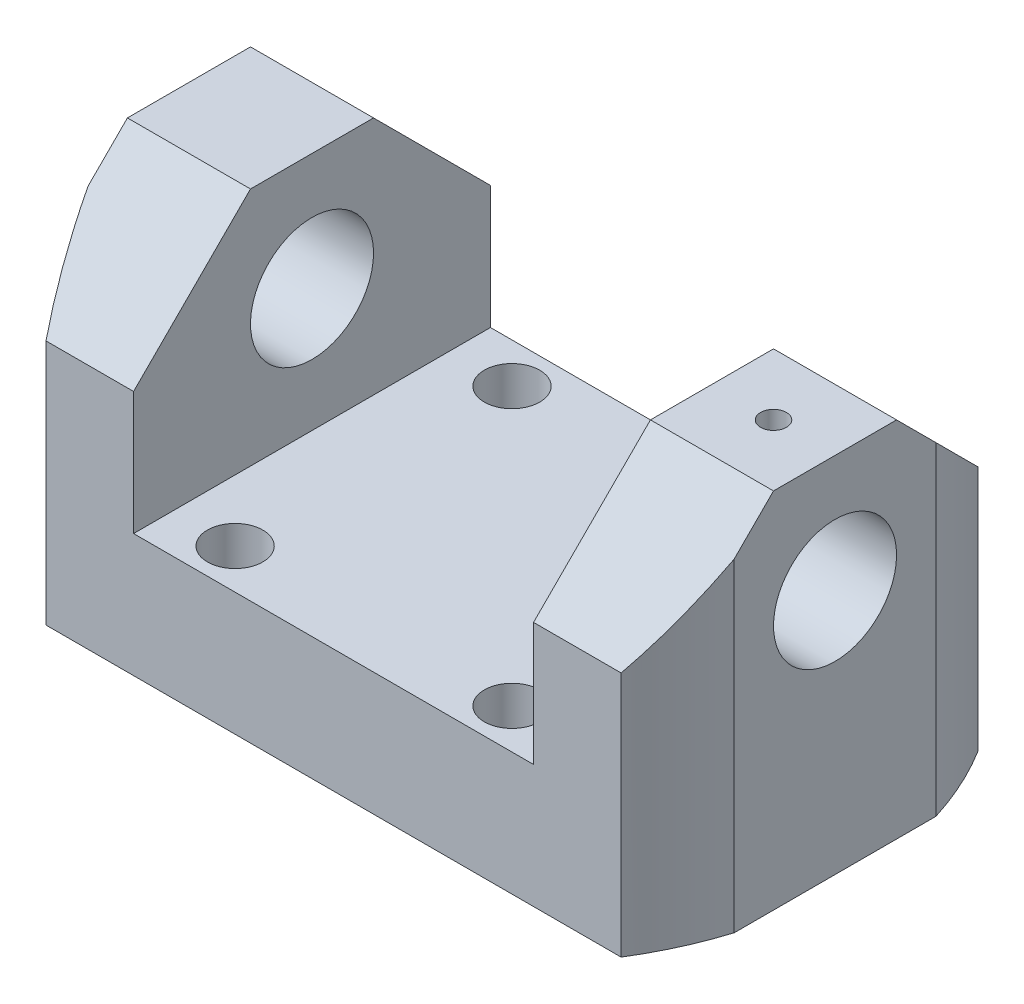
ISO-10303-21;
HEADER;
FILE_DESCRIPTION(('STEP AP214'),'2;1');
FILE_NAME('part.step','',(''),(''),'','','');
FILE_SCHEMA(('AUTOMOTIVE_DESIGN { 1 0 10303 214 1 1 1 1 }'));
ENDSEC;
DATA;
#1=APPLICATION_CONTEXT('core data for automotive mechanical design processes');
#2=APPLICATION_PROTOCOL_DEFINITION('international standard','automotive_design',2000,#1);
#3=PRODUCT_CONTEXT('',#1,'mechanical');
#4=PRODUCT('Part','Part','',(#3));
#5=PRODUCT_RELATED_PRODUCT_CATEGORY('part','',(#4));
#6=PRODUCT_DEFINITION_FORMATION('','',#4);
#7=PRODUCT_DEFINITION_CONTEXT('part definition',#1,'design');
#8=PRODUCT_DEFINITION('design','',#6,#7);
#9=PRODUCT_DEFINITION_SHAPE('','',#8);
#10=(LENGTH_UNIT() NAMED_UNIT(*) SI_UNIT(.MILLI.,.METRE.));
#11=(NAMED_UNIT(*) PLANE_ANGLE_UNIT() SI_UNIT($,.RADIAN.));
#12=(NAMED_UNIT(*) SI_UNIT($,.STERADIAN.) SOLID_ANGLE_UNIT());
#13=UNCERTAINTY_MEASURE_WITH_UNIT(LENGTH_MEASURE(1.E-05),#10,'distance_accuracy_value','');
#14=(GEOMETRIC_REPRESENTATION_CONTEXT(3) GLOBAL_UNCERTAINTY_ASSIGNED_CONTEXT((#13)) GLOBAL_UNIT_ASSIGNED_CONTEXT((#10,
#11,#12)) REPRESENTATION_CONTEXT('',''));
#15=CARTESIAN_POINT('',(0.,0.,0.));
#16=DIRECTION('',(0.,0.,1.));
#17=DIRECTION('',(1.,0.,0.));
#18=AXIS2_PLACEMENT_3D('',#15,#16,#17);
#19=CARTESIAN_POINT('',(105.,0.,58.));
#20=DIRECTION('',(0.,1.,0.));
#21=DIRECTION('',(-1.,0.,0.));
#22=AXIS2_PLACEMENT_3D('',#19,#20,#21);
#23=PLANE('',#22);
#24=CARTESIAN_POINT('',(30.,0.,6.50000000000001));
#25=DIRECTION('',(0.,1.,0.));
#26=DIRECTION('',(0.,0.,1.));
#27=AXIS2_PLACEMENT_3D('',#24,#25,#26);
#28=CIRCLE('',#27,4.5);
#29=CARTESIAN_POINT('',(30.,0.,11.));
#30=VERTEX_POINT('',#29);
#31=EDGE_CURVE('E271',#30,#30,#28,.T.);
#32=ORIENTED_EDGE('',*,*,#31,.T.);
#33=EDGE_LOOP('',(#32));
#34=FACE_BOUND('',#33,.T.);
#35=CARTESIAN_POINT('',(75.0000000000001,0.,6.50000000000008));
#36=DIRECTION('',(0.,1.,0.));
#37=DIRECTION('',(0.,0.,1.));
#38=AXIS2_PLACEMENT_3D('',#35,#36,#37);
#39=CIRCLE('',#38,4.5);
#40=CARTESIAN_POINT('',(75.0000000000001,0.,11.0000000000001));
#41=VERTEX_POINT('',#40);
#42=EDGE_CURVE('E277',#41,#41,#39,.T.);
#43=ORIENTED_EDGE('',*,*,#42,.T.);
#44=EDGE_LOOP('',(#43));
#45=FACE_BOUND('',#44,.T.);
#46=CARTESIAN_POINT('',(74.9999999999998,0.,51.5000000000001));
#47=DIRECTION('',(0.,1.,0.));
#48=DIRECTION('',(0.,0.,1.));
#49=AXIS2_PLACEMENT_3D('',#46,#47,#48);
#50=CIRCLE('',#49,4.5);
#51=CARTESIAN_POINT('',(74.9999999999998,0.,56.0000000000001));
#52=VERTEX_POINT('',#51);
#53=EDGE_CURVE('E283',#52,#52,#50,.T.);
#54=ORIENTED_EDGE('',*,*,#53,.T.);
#55=EDGE_LOOP('',(#54));
#56=FACE_BOUND('',#55,.T.);
#57=CARTESIAN_POINT('',(29.9999999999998,0.,51.4999999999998));
#58=DIRECTION('',(0.,1.,0.));
#59=DIRECTION('',(0.,0.,1.));
#60=AXIS2_PLACEMENT_3D('',#57,#58,#59);
#61=CIRCLE('',#60,4.5);
#62=CARTESIAN_POINT('',(29.9999999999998,0.,55.9999999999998));
#63=VERTEX_POINT('',#62);
#64=EDGE_CURVE('E289',#63,#63,#61,.T.);
#65=ORIENTED_EDGE('',*,*,#64,.T.);
#66=EDGE_LOOP('',(#65));
#67=FACE_BOUND('',#66,.T.);
#68=CARTESIAN_POINT('',(52.5,0.,29.));
#69=DIRECTION('',(0.,1.,0.));
#70=DIRECTION('',(0.,0.,1.));
#71=AXIS2_PLACEMENT_3D('',#68,#69,#70);
#72=CIRCLE('',#71,55.);
#73=CARTESIAN_POINT('',(0.,0.,45.393596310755));
#74=VERTEX_POINT('',#73);
#75=CARTESIAN_POINT('',(5.76671421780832,0.,58.));
#76=VERTEX_POINT('',#75);
#77=EDGE_CURVE('E160',#74,#76,#72,.T.);
#78=ORIENTED_EDGE('',*,*,#77,.F.);
#79=DIRECTION('',(0.,0.,-1.));
#80=VECTOR('',#79,1.);
#81=CARTESIAN_POINT('',(0.,0.,58.));
#82=LINE('',#81,#80);
#83=CARTESIAN_POINT('',(0.,0.,12.606403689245));
#84=VERTEX_POINT('',#83);
#85=EDGE_CURVE('E179',#74,#84,#82,.T.);
#86=ORIENTED_EDGE('',*,*,#85,.T.);
#87=CARTESIAN_POINT('',(5.76671421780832,0.,0.));
#88=VERTEX_POINT('',#87);
#89=EDGE_CURVE('E410',#88,#84,#72,.T.);
#90=ORIENTED_EDGE('',*,*,#89,.F.);
#91=DIRECTION('',(1.,0.,0.));
#92=VECTOR('',#91,1.);
#93=CARTESIAN_POINT('',(105.,0.,0.));
#94=LINE('',#93,#92);
#95=CARTESIAN_POINT('',(99.2332857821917,0.,0.));
#96=VERTEX_POINT('',#95);
#97=EDGE_CURVE('E180',#88,#96,#94,.T.);
#98=ORIENTED_EDGE('',*,*,#97,.T.);
#99=CARTESIAN_POINT('',(105.,0.,12.606403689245));
#100=VERTEX_POINT('',#99);
#101=EDGE_CURVE('E158',#100,#96,#72,.T.);
#102=ORIENTED_EDGE('',*,*,#101,.F.);
#103=DIRECTION('',(0.,0.,-1.));
#104=VECTOR('',#103,1.);
#105=CARTESIAN_POINT('',(105.,0.,58.));
#106=LINE('',#105,#104);
#107=CARTESIAN_POINT('',(105.,0.,45.393596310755));
#108=VERTEX_POINT('',#107);
#109=EDGE_CURVE('E156',#108,#100,#106,.T.);
#110=ORIENTED_EDGE('',*,*,#109,.F.);
#111=CARTESIAN_POINT('',(99.2332857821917,0.,58.));
#112=VERTEX_POINT('',#111);
#113=EDGE_CURVE('E143',#112,#108,#72,.T.);
#114=ORIENTED_EDGE('',*,*,#113,.F.);
#115=DIRECTION('',(1.,0.,0.));
#116=VECTOR('',#115,1.);
#117=CARTESIAN_POINT('',(105.,0.,58.));
#118=LINE('',#117,#116);
#119=EDGE_CURVE('E153',#76,#112,#118,.T.);
#120=ORIENTED_EDGE('',*,*,#119,.F.);
#121=EDGE_LOOP('',(#78,#86,#90,#98,#102,#110,#114,#120));
#122=FACE_BOUND('',#121,.T.);
#123=ADVANCED_FACE('F31',(#34,#45,#56,#67,#122),#23,.F.);
#124=CARTESIAN_POINT('',(105.,59.,58.));
#125=DIRECTION('',(-1.,0.,0.));
#126=DIRECTION('',(0.,-1.,0.));
#127=AXIS2_PLACEMENT_3D('',#124,#125,#126);
#128=PLANE('',#127);
#129=CARTESIAN_POINT('',(105.,40.,29.));
#130=DIRECTION('',(1.,0.,0.));
#131=DIRECTION('',(0.,0.,-1.));
#132=AXIS2_PLACEMENT_3D('',#129,#130,#131);
#133=CIRCLE('',#132,9.99999999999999);
#134=CARTESIAN_POINT('',(105.,40.,19.));
#135=VERTEX_POINT('',#134);
#136=EDGE_CURVE('E292',#135,#135,#133,.T.);
#137=ORIENTED_EDGE('',*,*,#136,.F.);
#138=EDGE_LOOP('',(#137));
#139=FACE_BOUND('',#138,.T.);
#140=DIRECTION('',(0.,1.,0.));
#141=VECTOR('',#140,1.);
#142=CARTESIAN_POINT('',(105.,0.,45.393596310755));
#143=LINE('',#142,#141);
#144=CARTESIAN_POINT('',(105.,52.6064036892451,45.3935963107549));
#145=VERTEX_POINT('',#144);
#146=EDGE_CURVE('E53',#108,#145,#143,.T.);
#147=ORIENTED_EDGE('',*,*,#146,.F.);
#148=ORIENTED_EDGE('',*,*,#109,.T.);
#149=DIRECTION('',(0.,1.,0.));
#150=VECTOR('',#149,1.);
#151=CARTESIAN_POINT('',(105.,0.,12.606403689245));
#152=LINE('',#151,#150);
#153=CARTESIAN_POINT('',(105.,52.606403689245,12.606403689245));
#154=VERTEX_POINT('',#153);
#155=EDGE_CURVE('E404',#154,#100,#152,.F.);
#156=ORIENTED_EDGE('',*,*,#155,.F.);
#157=DIRECTION('',(0.,0.707106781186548,0.707106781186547));
#158=VECTOR('',#157,1.);
#159=CARTESIAN_POINT('',(105.,59.,19.));
#160=LINE('',#159,#158);
#161=CARTESIAN_POINT('',(105.,59.,19.));
#162=VERTEX_POINT('',#161);
#163=EDGE_CURVE('E381',#154,#162,#160,.T.);
#164=ORIENTED_EDGE('',*,*,#163,.T.);
#165=DIRECTION('',(0.,0.,-1.));
#166=VECTOR('',#165,1.);
#167=CARTESIAN_POINT('',(105.,59.,58.));
#168=LINE('',#167,#166);
#169=CARTESIAN_POINT('',(105.,59.,39.));
#170=VERTEX_POINT('',#169);
#171=EDGE_CURVE('E203',#170,#162,#168,.T.);
#172=ORIENTED_EDGE('',*,*,#171,.F.);
#173=DIRECTION('',(0.,-0.707106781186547,0.707106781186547));
#174=VECTOR('',#173,1.);
#175=CARTESIAN_POINT('',(105.,59.,39.));
#176=LINE('',#175,#174);
#177=EDGE_CURVE('E251',#170,#145,#176,.T.);
#178=ORIENTED_EDGE('',*,*,#177,.T.);
#179=EDGE_LOOP('',(#147,#148,#156,#164,#172,#178));
#180=FACE_BOUND('',#179,.T.);
#181=ADVANCED_FACE('F324',(#139,#180),#128,.F.);
#182=CARTESIAN_POINT('',(0.,0.,58.));
#183=DIRECTION('',(1.,0.,0.));
#184=DIRECTION('',(0.,0.,-1.));
#185=AXIS2_PLACEMENT_3D('',#182,#183,#184);
#186=PLANE('',#185);
#187=CARTESIAN_POINT('',(0.,40.,29.));
#188=DIRECTION('',(1.,0.,0.));
#189=DIRECTION('',(0.,0.,-1.));
#190=AXIS2_PLACEMENT_3D('',#187,#188,#189);
#191=CIRCLE('',#190,9.99999999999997);
#192=CARTESIAN_POINT('',(0.,40.,19.));
#193=VERTEX_POINT('',#192);
#194=EDGE_CURVE('E295',#193,#193,#191,.T.);
#195=ORIENTED_EDGE('',*,*,#194,.T.);
#196=EDGE_LOOP('',(#195));
#197=FACE_BOUND('',#196,.T.);
#198=DIRECTION('',(0.,1.,0.));
#199=VECTOR('',#198,1.);
#200=CARTESIAN_POINT('',(0.,0.,12.606403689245));
#201=LINE('',#200,#199);
#202=CARTESIAN_POINT('',(0.,52.606403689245,12.606403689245));
#203=VERTEX_POINT('',#202);
#204=EDGE_CURVE('E416',#84,#203,#201,.T.);
#205=ORIENTED_EDGE('',*,*,#204,.F.);
#206=ORIENTED_EDGE('',*,*,#85,.F.);
#207=DIRECTION('',(0.,1.,0.));
#208=VECTOR('',#207,1.);
#209=CARTESIAN_POINT('',(0.,0.,45.393596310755));
#210=LINE('',#209,#208);
#211=CARTESIAN_POINT('',(0.,52.6064036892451,45.3935963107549));
#212=VERTEX_POINT('',#211);
#213=EDGE_CURVE('E370',#212,#74,#210,.F.);
#214=ORIENTED_EDGE('',*,*,#213,.F.);
#215=DIRECTION('',(0.,-0.707106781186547,0.707106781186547));
#216=VECTOR('',#215,1.);
#217=CARTESIAN_POINT('',(0.,59.,39.));
#218=LINE('',#217,#216);
#219=CARTESIAN_POINT('',(0.,59.,39.));
#220=VERTEX_POINT('',#219);
#221=EDGE_CURVE('E248',#220,#212,#218,.T.);
#222=ORIENTED_EDGE('',*,*,#221,.F.);
#223=DIRECTION('',(0.,0.,-1.));
#224=VECTOR('',#223,1.);
#225=CARTESIAN_POINT('',(0.,59.,58.));
#226=LINE('',#225,#224);
#227=CARTESIAN_POINT('',(0.,59.,19.));
#228=VERTEX_POINT('',#227);
#229=EDGE_CURVE('E188',#220,#228,#226,.T.);
#230=ORIENTED_EDGE('',*,*,#229,.T.);
#231=DIRECTION('',(0.,0.707106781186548,0.707106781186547));
#232=VECTOR('',#231,1.);
#233=CARTESIAN_POINT('',(0.,59.,19.));
#234=LINE('',#233,#232);
#235=EDGE_CURVE('E372',#203,#228,#234,.T.);
#236=ORIENTED_EDGE('',*,*,#235,.F.);
#237=EDGE_LOOP('',(#205,#206,#214,#222,#230,#236));
#238=FACE_BOUND('',#237,.T.);
#239=ADVANCED_FACE('F329',(#197,#238),#186,.F.);
#240=CARTESIAN_POINT('',(0.,0.,58.));
#241=DIRECTION('',(0.,0.,-1.));
#242=DIRECTION('',(-1.,0.,0.));
#243=AXIS2_PLACEMENT_3D('',#240,#241,#242);
#244=PLANE('',#243);
#245=DIRECTION('',(0.,1.,0.));
#246=VECTOR('',#245,1.);
#247=CARTESIAN_POINT('',(5.76671421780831,0.,58.));
#248=LINE('',#247,#246);
#249=CARTESIAN_POINT('',(5.76671421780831,40.,58.));
#250=VERTEX_POINT('',#249);
#251=EDGE_CURVE('E45',#76,#250,#248,.T.);
#252=ORIENTED_EDGE('',*,*,#251,.F.);
#253=ORIENTED_EDGE('',*,*,#119,.T.);
#254=DIRECTION('',(0.,1.,0.));
#255=VECTOR('',#254,1.);
#256=CARTESIAN_POINT('',(99.2332857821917,0.,58.));
#257=LINE('',#256,#255);
#258=CARTESIAN_POINT('',(99.2332857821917,40.,58.));
#259=VERTEX_POINT('',#258);
#260=EDGE_CURVE('E140',#259,#112,#257,.F.);
#261=ORIENTED_EDGE('',*,*,#260,.F.);
#262=DIRECTION('',(-1.,0.,0.));
#263=VECTOR('',#262,1.);
#264=CARTESIAN_POINT('',(105.,40.,58.));
#265=LINE('',#264,#263);
#266=CARTESIAN_POINT('',(85.,40.,58.));
#267=VERTEX_POINT('',#266);
#268=EDGE_CURVE('E260',#259,#267,#265,.T.);
#269=ORIENTED_EDGE('',*,*,#268,.T.);
#270=DIRECTION('',(0.,-1.,0.));
#271=VECTOR('',#270,1.);
#272=CARTESIAN_POINT('',(85.,20.,58.));
#273=LINE('',#272,#271);
#274=CARTESIAN_POINT('',(85.,20.,58.));
#275=VERTEX_POINT('',#274);
#276=EDGE_CURVE('E163',#267,#275,#273,.T.);
#277=ORIENTED_EDGE('',*,*,#276,.T.);
#278=DIRECTION('',(-1.,0.,0.));
#279=VECTOR('',#278,1.);
#280=CARTESIAN_POINT('',(20.,20.,58.));
#281=LINE('',#280,#279);
#282=CARTESIAN_POINT('',(20.,20.,58.));
#283=VERTEX_POINT('',#282);
#284=EDGE_CURVE('E166',#275,#283,#281,.T.);
#285=ORIENTED_EDGE('',*,*,#284,.T.);
#286=DIRECTION('',(0.,1.,0.));
#287=VECTOR('',#286,1.);
#288=CARTESIAN_POINT('',(20.,59.,58.));
#289=LINE('',#288,#287);
#290=CARTESIAN_POINT('',(20.,40.,58.));
#291=VERTEX_POINT('',#290);
#292=EDGE_CURVE('E176',#283,#291,#289,.T.);
#293=ORIENTED_EDGE('',*,*,#292,.T.);
#294=DIRECTION('',(-1.,0.,0.));
#295=VECTOR('',#294,1.);
#296=CARTESIAN_POINT('',(0.,40.,58.));
#297=LINE('',#296,#295);
#298=EDGE_CURVE('E207',#291,#250,#297,.T.);
#299=ORIENTED_EDGE('',*,*,#298,.T.);
#300=EDGE_LOOP('',(#252,#253,#261,#269,#277,#285,#293,#299));
#301=FACE_BOUND('',#300,.T.);
#302=ADVANCED_FACE('F161',(#301),#244,.F.);
#303=CARTESIAN_POINT('',(0.,0.,0.));
#304=DIRECTION('',(0.,0.,-1.));
#305=DIRECTION('',(-1.,0.,0.));
#306=AXIS2_PLACEMENT_3D('',#303,#304,#305);
#307=PLANE('',#306);
#308=ORIENTED_EDGE('',*,*,#97,.F.);
#309=DIRECTION('',(0.,1.,0.));
#310=VECTOR('',#309,1.);
#311=CARTESIAN_POINT('',(5.76671421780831,0.,0.));
#312=LINE('',#311,#310);
#313=CARTESIAN_POINT('',(5.76671421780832,40.,0.));
#314=VERTEX_POINT('',#313);
#315=EDGE_CURVE('E223',#88,#314,#312,.T.);
#316=ORIENTED_EDGE('',*,*,#315,.T.);
#317=DIRECTION('',(-1.,0.,0.));
#318=VECTOR('',#317,1.);
#319=CARTESIAN_POINT('',(0.,40.,0.));
#320=LINE('',#319,#318);
#321=CARTESIAN_POINT('',(20.,40.,0.));
#322=VERTEX_POINT('',#321);
#323=EDGE_CURVE('E38',#322,#314,#320,.T.);
#324=ORIENTED_EDGE('',*,*,#323,.F.);
#325=DIRECTION('',(0.,1.,0.));
#326=VECTOR('',#325,1.);
#327=CARTESIAN_POINT('',(20.,59.,0.));
#328=LINE('',#327,#326);
#329=CARTESIAN_POINT('',(20.,20.,0.));
#330=VERTEX_POINT('',#329);
#331=EDGE_CURVE('E164',#330,#322,#328,.T.);
#332=ORIENTED_EDGE('',*,*,#331,.F.);
#333=DIRECTION('',(-1.,0.,0.));
#334=VECTOR('',#333,1.);
#335=CARTESIAN_POINT('',(20.,20.,0.));
#336=LINE('',#335,#334);
#337=CARTESIAN_POINT('',(85.,20.,0.));
#338=VERTEX_POINT('',#337);
#339=EDGE_CURVE('E169',#338,#330,#336,.T.);
#340=ORIENTED_EDGE('',*,*,#339,.F.);
#341=DIRECTION('',(0.,-1.,0.));
#342=VECTOR('',#341,1.);
#343=CARTESIAN_POINT('',(85.,20.,0.));
#344=LINE('',#343,#342);
#345=CARTESIAN_POINT('',(85.,40.,0.));
#346=VERTEX_POINT('',#345);
#347=EDGE_CURVE('E183',#346,#338,#344,.T.);
#348=ORIENTED_EDGE('',*,*,#347,.F.);
#349=DIRECTION('',(-1.,0.,0.));
#350=VECTOR('',#349,1.);
#351=CARTESIAN_POINT('',(105.,40.,0.));
#352=LINE('',#351,#350);
#353=CARTESIAN_POINT('',(99.2332857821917,40.,0.));
#354=VERTEX_POINT('',#353);
#355=EDGE_CURVE('E237',#354,#346,#352,.T.);
#356=ORIENTED_EDGE('',*,*,#355,.F.);
#357=DIRECTION('',(0.,1.,0.));
#358=VECTOR('',#357,1.);
#359=CARTESIAN_POINT('',(99.2332857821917,0.,0.));
#360=LINE('',#359,#358);
#361=EDGE_CURVE('E157',#354,#96,#360,.F.);
#362=ORIENTED_EDGE('',*,*,#361,.T.);
#363=EDGE_LOOP('',(#308,#316,#324,#332,#340,#348,#356,#362));
#364=FACE_BOUND('',#363,.T.);
#365=ADVANCED_FACE('F221',(#364),#307,.T.);
#366=CARTESIAN_POINT('',(105.,59.,39.));
#367=DIRECTION('',(0.,-0.707106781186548,-0.707106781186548));
#368=DIRECTION('',(0.,0.707106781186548,-0.707106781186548));
#369=AXIS2_PLACEMENT_3D('',#366,#367,#368);
#370=PLANE('',#369);
#371=CARTESIAN_POINT('',(52.5,69.,29.));
#372=DIRECTION('',(0.,-0.707106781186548,-0.707106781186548));
#373=DIRECTION('',(0.,0.707106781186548,-0.707106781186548));
#374=AXIS2_PLACEMENT_3D('',#371,#372,#373);
#375=ELLIPSE('',#374,77.7817459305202,55.);
#376=EDGE_CURVE('E411',#250,#212,#375,.T.);
#377=ORIENTED_EDGE('',*,*,#376,.F.);
#378=ORIENTED_EDGE('',*,*,#298,.F.);
#379=DIRECTION('',(0.,-0.707106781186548,0.707106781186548));
#380=VECTOR('',#379,1.);
#381=CARTESIAN_POINT('',(20.,49.5,48.5));
#382=LINE('',#381,#380);
#383=CARTESIAN_POINT('',(20.,59.,39.));
#384=VERTEX_POINT('',#383);
#385=EDGE_CURVE('E262',#384,#291,#382,.T.);
#386=ORIENTED_EDGE('',*,*,#385,.F.);
#387=DIRECTION('',(-1.,0.,0.));
#388=VECTOR('',#387,1.);
#389=CARTESIAN_POINT('',(105.,59.,39.));
#390=LINE('',#389,#388);
#391=EDGE_CURVE('E258',#384,#220,#390,.T.);
#392=ORIENTED_EDGE('',*,*,#391,.T.);
#393=ORIENTED_EDGE('',*,*,#221,.T.);
#394=EDGE_LOOP('',(#377,#378,#386,#392,#393));
#395=FACE_BOUND('',#394,.T.);
#396=ADVANCED_FACE('F432',(#395),#370,.F.);
#397=CARTESIAN_POINT('',(52.5,69.,29.));
#398=DIRECTION('',(0.,-0.707106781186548,-0.707106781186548));
#399=DIRECTION('',(0.,0.707106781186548,-0.707106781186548));
#400=AXIS2_PLACEMENT_3D('',#397,#398,#399);
#401=ELLIPSE('',#400,77.7817459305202,55.);
#402=EDGE_CURVE('E144',#145,#259,#401,.T.);
#403=ORIENTED_EDGE('',*,*,#402,.F.);
#404=ORIENTED_EDGE('',*,*,#177,.F.);
#405=CARTESIAN_POINT('',(85.,59.,39.));
#406=VERTEX_POINT('',#405);
#407=EDGE_CURVE('E263',#170,#406,#390,.T.);
#408=ORIENTED_EDGE('',*,*,#407,.T.);
#409=DIRECTION('',(0.,0.707106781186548,-0.707106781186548));
#410=VECTOR('',#409,1.);
#411=CARTESIAN_POINT('',(85.,30.,68.));
#412=LINE('',#411,#410);
#413=EDGE_CURVE('E266',#267,#406,#412,.T.);
#414=ORIENTED_EDGE('',*,*,#413,.F.);
#415=ORIENTED_EDGE('',*,*,#268,.F.);
#416=EDGE_LOOP('',(#403,#404,#408,#414,#415));
#417=FACE_BOUND('',#416,.T.);
#418=ADVANCED_FACE('F435',(#417),#370,.F.);
#419=CARTESIAN_POINT('',(105.,59.,19.));
#420=DIRECTION('',(0.,-0.707106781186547,0.707106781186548));
#421=DIRECTION('',(0.,-0.707106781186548,-0.707106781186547));
#422=AXIS2_PLACEMENT_3D('',#419,#420,#421);
#423=PLANE('',#422);
#424=CARTESIAN_POINT('',(52.5,69.,29.));
#425=DIRECTION('',(0.,-0.707106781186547,0.707106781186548));
#426=DIRECTION('',(0.,0.707106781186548,0.707106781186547));
#427=AXIS2_PLACEMENT_3D('',#424,#425,#426);
#428=ELLIPSE('',#427,77.7817459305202,55.);
#429=EDGE_CURVE('E213',#203,#314,#428,.T.);
#430=ORIENTED_EDGE('',*,*,#429,.F.);
#431=ORIENTED_EDGE('',*,*,#235,.T.);
#432=DIRECTION('',(-1.,0.,0.));
#433=VECTOR('',#432,1.);
#434=CARTESIAN_POINT('',(105.,59.,19.));
#435=LINE('',#434,#433);
#436=CARTESIAN_POINT('',(20.,59.,19.));
#437=VERTEX_POINT('',#436);
#438=EDGE_CURVE('E420',#437,#228,#435,.T.);
#439=ORIENTED_EDGE('',*,*,#438,.F.);
#440=DIRECTION('',(0.,0.707106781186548,0.707106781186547));
#441=VECTOR('',#440,1.);
#442=CARTESIAN_POINT('',(20.,78.5,38.5));
#443=LINE('',#442,#441);
#444=EDGE_CURVE('E216',#322,#437,#443,.T.);
#445=ORIENTED_EDGE('',*,*,#444,.F.);
#446=ORIENTED_EDGE('',*,*,#323,.T.);
#447=EDGE_LOOP('',(#430,#431,#439,#445,#446));
#448=FACE_BOUND('',#447,.T.);
#449=ADVANCED_FACE('F212',(#448),#423,.F.);
#450=CARTESIAN_POINT('',(52.5,69.,29.));
#451=DIRECTION('',(0.,-0.707106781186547,0.707106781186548));
#452=DIRECTION('',(0.,0.707106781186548,0.707106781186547));
#453=AXIS2_PLACEMENT_3D('',#450,#451,#452);
#454=ELLIPSE('',#453,77.7817459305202,55.);
#455=EDGE_CURVE('E12',#354,#154,#454,.T.);
#456=ORIENTED_EDGE('',*,*,#455,.F.);
#457=ORIENTED_EDGE('',*,*,#355,.T.);
#458=DIRECTION('',(0.,-0.707106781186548,-0.707106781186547));
#459=VECTOR('',#458,1.);
#460=CARTESIAN_POINT('',(85.,59.,19.));
#461=LINE('',#460,#459);
#462=CARTESIAN_POINT('',(85.,59.,19.));
#463=VERTEX_POINT('',#462);
#464=EDGE_CURVE('E242',#463,#346,#461,.T.);
#465=ORIENTED_EDGE('',*,*,#464,.F.);
#466=EDGE_CURVE('E253',#162,#463,#435,.T.);
#467=ORIENTED_EDGE('',*,*,#466,.F.);
#468=ORIENTED_EDGE('',*,*,#163,.F.);
#469=EDGE_LOOP('',(#456,#457,#465,#467,#468));
#470=FACE_BOUND('',#469,.T.);
#471=ADVANCED_FACE('F356',(#470),#423,.F.);
#472=CARTESIAN_POINT('',(85.,59.,58.));
#473=DIRECTION('',(0.,-1.,0.));
#474=DIRECTION('',(0.,0.,-1.));
#475=AXIS2_PLACEMENT_3D('',#472,#473,#474);
#476=PLANE('',#475);
#477=ORIENTED_EDGE('',*,*,#171,.T.);
#478=ORIENTED_EDGE('',*,*,#466,.T.);
#479=DIRECTION('',(0.,0.,-1.));
#480=VECTOR('',#479,1.);
#481=CARTESIAN_POINT('',(85.,59.,58.));
#482=LINE('',#481,#480);
#483=EDGE_CURVE('E200',#406,#463,#482,.T.);
#484=ORIENTED_EDGE('',*,*,#483,.F.);
#485=ORIENTED_EDGE('',*,*,#407,.F.);
#486=EDGE_LOOP('',(#477,#478,#484,#485));
#487=FACE_BOUND('',#486,.T.);
#488=CARTESIAN_POINT('',(95.,59.,29.));
#489=DIRECTION('',(0.,1.,0.));
#490=DIRECTION('',(0.,0.,1.));
#491=AXIS2_PLACEMENT_3D('',#488,#489,#490);
#492=CIRCLE('',#491,2.09999999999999);
#493=CARTESIAN_POINT('',(95.,59.,31.1));
#494=VERTEX_POINT('',#493);
#495=EDGE_CURVE('E367',#494,#494,#492,.T.);
#496=ORIENTED_EDGE('',*,*,#495,.F.);
#497=EDGE_LOOP('',(#496));
#498=FACE_BOUND('',#497,.T.);
#499=ADVANCED_FACE('F349',(#487,#498),#476,.F.);
#500=CARTESIAN_POINT('',(85.,20.,58.));
#501=DIRECTION('',(1.,0.,0.));
#502=DIRECTION('',(0.,0.,-1.));
#503=AXIS2_PLACEMENT_3D('',#500,#501,#502);
#504=PLANE('',#503);
#505=CARTESIAN_POINT('',(85.,40.,29.));
#506=DIRECTION('',(1.,0.,0.));
#507=DIRECTION('',(0.,0.,-1.));
#508=AXIS2_PLACEMENT_3D('',#505,#506,#507);
#509=CIRCLE('',#508,9.99999999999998);
#510=CARTESIAN_POINT('',(85.,40.,19.));
#511=VERTEX_POINT('',#510);
#512=EDGE_CURVE('E172',#511,#511,#509,.T.);
#513=ORIENTED_EDGE('',*,*,#512,.T.);
#514=EDGE_LOOP('',(#513));
#515=FACE_BOUND('',#514,.T.);
#516=ORIENTED_EDGE('',*,*,#483,.T.);
#517=ORIENTED_EDGE('',*,*,#464,.T.);
#518=ORIENTED_EDGE('',*,*,#347,.T.);
#519=DIRECTION('',(0.,0.,-1.));
#520=VECTOR('',#519,1.);
#521=CARTESIAN_POINT('',(85.,20.,58.));
#522=LINE('',#521,#520);
#523=EDGE_CURVE('E197',#275,#338,#522,.T.);
#524=ORIENTED_EDGE('',*,*,#523,.F.);
#525=ORIENTED_EDGE('',*,*,#276,.F.);
#526=ORIENTED_EDGE('',*,*,#413,.T.);
#527=EDGE_LOOP('',(#516,#517,#518,#524,#525,#526));
#528=FACE_BOUND('',#527,.T.);
#529=ADVANCED_FACE('F240',(#515,#528),#504,.F.);
#530=CARTESIAN_POINT('',(20.,20.,58.));
#531=DIRECTION('',(0.,-1.,0.));
#532=DIRECTION('',(0.,0.,-1.));
#533=AXIS2_PLACEMENT_3D('',#530,#531,#532);
#534=PLANE('',#533);
#535=CARTESIAN_POINT('',(30.,20.,6.50000000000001));
#536=DIRECTION('',(0.,1.,0.));
#537=DIRECTION('',(0.,0.,1.));
#538=AXIS2_PLACEMENT_3D('',#535,#536,#537);
#539=CIRCLE('',#538,4.49999999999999);
#540=CARTESIAN_POINT('',(30.,20.,11.));
#541=VERTEX_POINT('',#540);
#542=EDGE_CURVE('E268',#541,#541,#539,.T.);
#543=ORIENTED_EDGE('',*,*,#542,.F.);
#544=EDGE_LOOP('',(#543));
#545=FACE_BOUND('',#544,.T.);
#546=CARTESIAN_POINT('',(75.0000000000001,20.,6.50000000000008));
#547=DIRECTION('',(0.,1.,0.));
#548=DIRECTION('',(0.,0.,1.));
#549=AXIS2_PLACEMENT_3D('',#546,#547,#548);
#550=CIRCLE('',#549,4.49999999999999);
#551=CARTESIAN_POINT('',(75.0000000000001,20.,11.0000000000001));
#552=VERTEX_POINT('',#551);
#553=EDGE_CURVE('E274',#552,#552,#550,.T.);
#554=ORIENTED_EDGE('',*,*,#553,.F.);
#555=EDGE_LOOP('',(#554));
#556=FACE_BOUND('',#555,.T.);
#557=CARTESIAN_POINT('',(74.9999999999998,20.,51.5000000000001));
#558=DIRECTION('',(0.,1.,0.));
#559=DIRECTION('',(0.,0.,1.));
#560=AXIS2_PLACEMENT_3D('',#557,#558,#559);
#561=CIRCLE('',#560,4.49999999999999);
#562=CARTESIAN_POINT('',(74.9999999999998,20.,56.0000000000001));
#563=VERTEX_POINT('',#562);
#564=EDGE_CURVE('E280',#563,#563,#561,.T.);
#565=ORIENTED_EDGE('',*,*,#564,.F.);
#566=EDGE_LOOP('',(#565));
#567=FACE_BOUND('',#566,.T.);
#568=CARTESIAN_POINT('',(29.9999999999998,20.,51.4999999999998));
#569=DIRECTION('',(0.,1.,0.));
#570=DIRECTION('',(0.,0.,1.));
#571=AXIS2_PLACEMENT_3D('',#568,#569,#570);
#572=CIRCLE('',#571,4.49999999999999);
#573=CARTESIAN_POINT('',(29.9999999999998,20.,55.9999999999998));
#574=VERTEX_POINT('',#573);
#575=EDGE_CURVE('E286',#574,#574,#572,.T.);
#576=ORIENTED_EDGE('',*,*,#575,.F.);
#577=EDGE_LOOP('',(#576));
#578=FACE_BOUND('',#577,.T.);
#579=ORIENTED_EDGE('',*,*,#339,.T.);
#580=DIRECTION('',(0.,0.,-1.));
#581=VECTOR('',#580,1.);
#582=CARTESIAN_POINT('',(20.,20.,58.));
#583=LINE('',#582,#581);
#584=EDGE_CURVE('E194',#283,#330,#583,.T.);
#585=ORIENTED_EDGE('',*,*,#584,.F.);
#586=ORIENTED_EDGE('',*,*,#284,.F.);
#587=ORIENTED_EDGE('',*,*,#523,.T.);
#588=EDGE_LOOP('',(#579,#585,#586,#587));
#589=FACE_BOUND('',#588,.T.);
#590=ADVANCED_FACE('F232',(#545,#556,#567,#578,#589),#534,.F.);
#591=CARTESIAN_POINT('',(20.,59.,58.));
#592=DIRECTION('',(-1.,0.,0.));
#593=DIRECTION('',(0.,-1.,0.));
#594=AXIS2_PLACEMENT_3D('',#591,#592,#593);
#595=PLANE('',#594);
#596=CARTESIAN_POINT('',(20.,40.,29.));
#597=DIRECTION('',(-1.,0.,0.));
#598=DIRECTION('',(0.,-1.,0.));
#599=AXIS2_PLACEMENT_3D('',#596,#597,#598);
#600=CIRCLE('',#599,9.99999999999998);
#601=CARTESIAN_POINT('',(20.,30.,29.));
#602=VERTEX_POINT('',#601);
#603=EDGE_CURVE('E297',#602,#602,#600,.T.);
#604=ORIENTED_EDGE('',*,*,#603,.T.);
#605=EDGE_LOOP('',(#604));
#606=FACE_BOUND('',#605,.T.);
#607=ORIENTED_EDGE('',*,*,#331,.T.);
#608=ORIENTED_EDGE('',*,*,#444,.T.);
#609=DIRECTION('',(0.,0.,-1.));
#610=VECTOR('',#609,1.);
#611=CARTESIAN_POINT('',(20.,59.,58.));
#612=LINE('',#611,#610);
#613=EDGE_CURVE('E191',#384,#437,#612,.T.);
#614=ORIENTED_EDGE('',*,*,#613,.F.);
#615=ORIENTED_EDGE('',*,*,#385,.T.);
#616=ORIENTED_EDGE('',*,*,#292,.F.);
#617=ORIENTED_EDGE('',*,*,#584,.T.);
#618=EDGE_LOOP('',(#607,#608,#614,#615,#616,#617));
#619=FACE_BOUND('',#618,.T.);
#620=ADVANCED_FACE('F225',(#606,#619),#595,.F.);
#621=CARTESIAN_POINT('',(0.,59.,58.));
#622=DIRECTION('',(0.,-1.,0.));
#623=DIRECTION('',(0.,0.,-1.));
#624=AXIS2_PLACEMENT_3D('',#621,#622,#623);
#625=PLANE('',#624);
#626=ORIENTED_EDGE('',*,*,#613,.T.);
#627=ORIENTED_EDGE('',*,*,#438,.T.);
#628=ORIENTED_EDGE('',*,*,#229,.F.);
#629=ORIENTED_EDGE('',*,*,#391,.F.);
#630=EDGE_LOOP('',(#626,#627,#628,#629));
#631=FACE_BOUND('',#630,.T.);
#632=ADVANCED_FACE('F318',(#631),#625,.F.);
#633=CARTESIAN_POINT('',(105.,40.,29.));
#634=DIRECTION('',(1.,0.,0.));
#635=DIRECTION('',(0.,0.,-1.));
#636=AXIS2_PLACEMENT_3D('',#633,#634,#635);
#637=CYLINDRICAL_SURFACE('',#636,9.99999999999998);
#638=ORIENTED_EDGE('',*,*,#194,.F.);
#639=EDGE_LOOP('',(#638));
#640=FACE_BOUND('',#639,.T.);
#641=ORIENTED_EDGE('',*,*,#603,.F.);
#642=EDGE_LOOP('',(#641));
#643=FACE_BOUND('',#642,.T.);
#644=ADVANCED_FACE('F308',(#640,#643),#637,.F.);
#645=CARTESIAN_POINT('',(95.,49.7770138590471,31.1));
#646=CARTESIAN_POINT('',(95.1165538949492,49.777016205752,31.0999958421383));
#647=CARTESIAN_POINT('',(95.233158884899,49.7791207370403,31.0902635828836));
#648=CARTESIAN_POINT('',(95.463061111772,49.7872974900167,31.0516294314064));
#649=CARTESIAN_POINT('',(95.5763557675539,49.7933727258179,31.0227129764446));
#650=CARTESIAN_POINT('',(95.7962782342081,49.8087731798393,30.9466542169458));
#651=CARTESIAN_POINT('',(95.902912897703,49.818094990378,30.8995310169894));
#652=CARTESIAN_POINT('',(96.1067626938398,49.838934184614,30.7884500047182));
#653=CARTESIAN_POINT('',(96.2039781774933,49.8504514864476,30.7244928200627));
#654=CARTESIAN_POINT('',(96.3877477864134,49.8745844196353,30.5804972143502));
#655=CARTESIAN_POINT('',(96.4741337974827,49.8872131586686,30.5002464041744));
#656=CARTESIAN_POINT('',(96.6323221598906,49.9120309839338,30.3264002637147));
#657=CARTESIAN_POINT('',(96.7041234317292,49.9242200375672,30.2328039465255));
#658=CARTESIAN_POINT('',(96.8317631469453,49.9469272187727,30.033803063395));
#659=CARTESIAN_POINT('',(96.8874408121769,49.9574280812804,29.9282932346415));
#660=CARTESIAN_POINT('',(96.9802139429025,49.9754280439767,29.7091580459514));
#661=CARTESIAN_POINT('',(97.0173113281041,49.9829274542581,29.5955335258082));
#662=CARTESIAN_POINT('',(97.0713446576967,49.9939869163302,29.3651408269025));
#663=CARTESIAN_POINT('',(97.088564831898,49.9976024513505,29.248442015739));
#664=CARTESIAN_POINT('',(97.1032426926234,50.0006787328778,29.0137595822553));
#665=CARTESIAN_POINT('',(97.1007024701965,50.0001399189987,28.8957760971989));
#666=CARTESIAN_POINT('',(97.0761451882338,49.9950108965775,28.6638298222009));
#667=CARTESIAN_POINT('',(97.0544343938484,49.9904843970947,28.5498329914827));
#668=CARTESIAN_POINT('',(96.9926392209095,49.9779608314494,28.3271375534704));
#669=CARTESIAN_POINT('',(96.9525540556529,49.9699636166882,28.2184391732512));
#670=CARTESIAN_POINT('',(96.8548710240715,49.9512935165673,28.0085648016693));
#671=CARTESIAN_POINT('',(96.7971552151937,49.9406026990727,27.9074453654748));
#672=CARTESIAN_POINT('',(96.6659368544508,49.9177206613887,27.7162143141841));
#673=CARTESIAN_POINT('',(96.5924323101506,49.9055292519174,27.6261040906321));
#674=CARTESIAN_POINT('',(96.4300494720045,49.8807133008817,27.457629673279));
#675=CARTESIAN_POINT('',(96.3409031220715,49.8680849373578,27.379524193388));
#676=CARTESIAN_POINT('',(96.1506482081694,49.8440389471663,27.2393263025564));
#677=CARTESIAN_POINT('',(96.0495393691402,49.83262134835,27.1772342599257));
#678=CARTESIAN_POINT('',(95.8378336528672,49.8122807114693,27.0707232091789));
#679=CARTESIAN_POINT('',(95.7272132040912,49.8033641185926,27.0263497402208));
#680=CARTESIAN_POINT('',(95.4998551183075,49.7891267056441,26.9568974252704));
#681=CARTESIAN_POINT('',(95.3831183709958,49.7838053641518,26.9318157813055));
#682=CARTESIAN_POINT('',(95.1491962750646,49.7774664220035,26.9020533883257));
#683=CARTESIAN_POINT('',(95.0320607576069,49.7763696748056,26.8969974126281));
#684=CARTESIAN_POINT('',(94.7986203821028,49.7783910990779,26.9064169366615));
#685=CARTESIAN_POINT('',(94.682315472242,49.7815090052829,26.9208912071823));
#686=CARTESIAN_POINT('',(94.4551226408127,49.7915339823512,26.9686357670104));
#687=CARTESIAN_POINT('',(94.3441899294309,49.7983999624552,27.0017023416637));
#688=CARTESIAN_POINT('',(94.1294392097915,49.815110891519,27.0854736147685));
#689=CARTESIAN_POINT('',(94.0256218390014,49.8249561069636,27.1361798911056));
#690=CARTESIAN_POINT('',(93.8264163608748,49.8466919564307,27.2546286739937));
#691=CARTESIAN_POINT('',(93.7311697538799,49.8586097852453,27.3226040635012));
#692=CARTESIAN_POINT('',(93.5532979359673,49.8830749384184,27.47335407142));
#693=CARTESIAN_POINT('',(93.4706741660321,49.8956223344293,27.5561303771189));
#694=CARTESIAN_POINT('',(93.3189530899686,49.9201918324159,27.735824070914));
#695=CARTESIAN_POINT('',(93.2501106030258,49.9322013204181,27.8329586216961));
#696=CARTESIAN_POINT('',(93.1297214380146,49.9541159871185,28.0376320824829));
#697=CARTESIAN_POINT('',(93.0781739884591,49.9640212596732,28.1451705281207));
#698=CARTESIAN_POINT('',(92.9942009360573,49.9805579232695,28.366957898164));
#699=CARTESIAN_POINT('',(92.9616599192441,49.9872090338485,28.4811615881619));
#700=CARTESIAN_POINT('',(92.9162603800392,49.9965729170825,28.7135689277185));
#701=CARTESIAN_POINT('',(92.9033992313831,49.9992862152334,28.8317720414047));
#702=CARTESIAN_POINT('',(92.8978348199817,50.0004546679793,29.0663968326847));
#703=CARTESIAN_POINT('',(92.9047498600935,49.9989904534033,29.1828092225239));
#704=CARTESIAN_POINT('',(92.9376929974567,49.9921396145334,29.4127733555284));
#705=CARTESIAN_POINT('',(92.9637208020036,49.9867530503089,29.5263251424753));
#706=CARTESIAN_POINT('',(93.0339739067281,49.9726669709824,29.7470767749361));
#707=CARTESIAN_POINT('',(93.0781489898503,49.963976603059,29.8542932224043));
#708=CARTESIAN_POINT('',(93.1833921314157,49.944214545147,30.0598450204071));
#709=CARTESIAN_POINT('',(93.2444616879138,49.9331426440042,30.158179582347));
#710=CARTESIAN_POINT('',(93.3830253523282,49.9095850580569,30.3450504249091));
#711=CARTESIAN_POINT('',(93.460790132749,49.8970778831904,30.4333833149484));
#712=CARTESIAN_POINT('',(93.6299858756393,49.872180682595,30.5958766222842));
#713=CARTESIAN_POINT('',(93.7214200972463,49.8597906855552,30.6700336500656));
#714=CARTESIAN_POINT('',(93.9166895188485,49.8363643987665,30.80292990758));
#715=CARTESIAN_POINT('',(94.0206614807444,49.8253463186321,30.8614715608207));
#716=CARTESIAN_POINT('',(94.2371732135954,49.806137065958,30.960158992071));
#717=CARTESIAN_POINT('',(94.3497053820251,49.7979434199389,31.0003208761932));
#718=CARTESIAN_POINT('',(94.5520174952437,49.7868835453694,31.0536424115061));
#719=CARTESIAN_POINT('',(94.6406720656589,49.78320619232,31.0709942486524));
#720=CARTESIAN_POINT('',(94.8195409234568,49.7782704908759,31.0941744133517));
#721=CARTESIAN_POINT('',(94.9097551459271,49.7770120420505,31.1000032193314));
#722=CARTESIAN_POINT('',(95.,49.7770138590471,31.1));
#723=B_SPLINE_CURVE_WITH_KNOTS('',3,(#645,#646,#647,#648,#649,#650,#651,#652,#653,#654,#655,
#656,#657,#658,#659,#660,#661,#662,#663,#664,#665,#666,#667,#668,#669,#670,#671,#672,#673,#674,
#675,#676,#677,#678,#679,#680,#681,#682,#683,#684,#685,#686,#687,#688,#689,#690,#691,#692,#693,
#694,#695,#696,#697,#698,#699,#700,#701,#702,#703,#704,#705,#706,#707,#708,#709,#710,#711,#712,
#713,#714,#715,#716,#717,#718,#719,#720,#721,#722),.UNSPECIFIED.,.T.,.F.,(4,2,2,2,2,2,2,2,2,2,2,
2,2,2,2,2,2,2,2,2,2,2,2,2,2,2,2,2,2,2,2,2,2,2,2,2,2,2,4),(0.,0.349331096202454,0.69892767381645,
1.04815840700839,1.39737612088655,1.75147768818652,2.10560545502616,2.46315158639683,
2.82066076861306,3.17299189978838,3.52528574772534,3.87205123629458,4.2188315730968,
4.56798452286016,4.91718155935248,5.27308253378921,5.62899169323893,5.98580978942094,
6.34257612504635,6.69262508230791,7.04265200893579,7.38891642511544,7.73521182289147,
8.08645110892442,8.43773046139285,8.79500286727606,9.15225933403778,9.50732322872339,
9.86233973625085,10.2105506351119,10.5587562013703,10.9060046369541,11.2532838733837,
11.6066878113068,11.960176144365,12.3179450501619,12.6753998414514,12.9458896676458,
13.2163682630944),.UNSPECIFIED.);
#724=CARTESIAN_POINT('',(95.,49.7770138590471,31.1));
#725=VERTEX_POINT('',#724);
#726=EDGE_CURVE('E369',#725,#725,#723,.T.);
#727=ORIENTED_EDGE('',*,*,#726,.T.);
#728=EDGE_LOOP('',(#727));
#729=FACE_BOUND('',#728,.T.);
#730=ORIENTED_EDGE('',*,*,#136,.T.);
#731=EDGE_LOOP('',(#730));
#732=FACE_BOUND('',#731,.T.);
#733=ORIENTED_EDGE('',*,*,#512,.F.);
#734=EDGE_LOOP('',(#733));
#735=FACE_BOUND('',#734,.T.);
#736=ADVANCED_FACE('F305',(#729,#732,#735),#637,.F.);
#737=CARTESIAN_POINT('',(29.9999999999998,20.,51.4999999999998));
#738=DIRECTION('',(0.,1.,0.));
#739=DIRECTION('',(0.,0.,1.));
#740=AXIS2_PLACEMENT_3D('',#737,#738,#739);
#741=CYLINDRICAL_SURFACE('',#740,4.49999999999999);
#742=ORIENTED_EDGE('',*,*,#64,.F.);
#743=EDGE_LOOP('',(#742));
#744=FACE_BOUND('',#743,.T.);
#745=ORIENTED_EDGE('',*,*,#575,.T.);
#746=EDGE_LOOP('',(#745));
#747=FACE_BOUND('',#746,.T.);
#748=ADVANCED_FACE('F307',(#744,#747),#741,.F.);
#749=CARTESIAN_POINT('',(74.9999999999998,20.,51.5000000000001));
#750=DIRECTION('',(0.,1.,0.));
#751=DIRECTION('',(0.,0.,1.));
#752=AXIS2_PLACEMENT_3D('',#749,#750,#751);
#753=CYLINDRICAL_SURFACE('',#752,4.5);
#754=ORIENTED_EDGE('',*,*,#53,.F.);
#755=EDGE_LOOP('',(#754));
#756=FACE_BOUND('',#755,.T.);
#757=ORIENTED_EDGE('',*,*,#564,.T.);
#758=EDGE_LOOP('',(#757));
#759=FACE_BOUND('',#758,.T.);
#760=ADVANCED_FACE('F315',(#756,#759),#753,.F.);
#761=CARTESIAN_POINT('',(75.0000000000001,20.,6.50000000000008));
#762=DIRECTION('',(0.,1.,0.));
#763=DIRECTION('',(0.,0.,1.));
#764=AXIS2_PLACEMENT_3D('',#761,#762,#763);
#765=CYLINDRICAL_SURFACE('',#764,4.5);
#766=ORIENTED_EDGE('',*,*,#42,.F.);
#767=EDGE_LOOP('',(#766));
#768=FACE_BOUND('',#767,.T.);
#769=ORIENTED_EDGE('',*,*,#553,.T.);
#770=EDGE_LOOP('',(#769));
#771=FACE_BOUND('',#770,.T.);
#772=ADVANCED_FACE('F445',(#768,#771),#765,.F.);
#773=CARTESIAN_POINT('',(30.,20.,6.50000000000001));
#774=DIRECTION('',(0.,1.,0.));
#775=DIRECTION('',(0.,0.,1.));
#776=AXIS2_PLACEMENT_3D('',#773,#774,#775);
#777=CYLINDRICAL_SURFACE('',#776,4.49999999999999);
#778=ORIENTED_EDGE('',*,*,#31,.F.);
#779=EDGE_LOOP('',(#778));
#780=FACE_BOUND('',#779,.T.);
#781=ORIENTED_EDGE('',*,*,#542,.T.);
#782=EDGE_LOOP('',(#781));
#783=FACE_BOUND('',#782,.T.);
#784=ADVANCED_FACE('F389',(#780,#783),#777,.F.);
#785=CARTESIAN_POINT('',(95.,59.,29.));
#786=DIRECTION('',(0.,1.,0.));
#787=DIRECTION('',(0.,0.,1.));
#788=AXIS2_PLACEMENT_3D('',#785,#786,#787);
#789=CYLINDRICAL_SURFACE('',#788,2.09999999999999);
#790=ORIENTED_EDGE('',*,*,#726,.F.);
#791=EDGE_LOOP('',(#790));
#792=FACE_BOUND('',#791,.T.);
#793=ORIENTED_EDGE('',*,*,#495,.T.);
#794=EDGE_LOOP('',(#793));
#795=FACE_BOUND('',#794,.T.);
#796=ADVANCED_FACE('F384',(#792,#795),#789,.F.);
#797=CARTESIAN_POINT('',(52.5,0.,29.));
#798=DIRECTION('',(0.,1.,0.));
#799=DIRECTION('',(0.,0.,1.));
#800=AXIS2_PLACEMENT_3D('',#797,#798,#799);
#801=CYLINDRICAL_SURFACE('',#800,55.);
#802=ORIENTED_EDGE('',*,*,#155,.T.);
#803=ORIENTED_EDGE('',*,*,#101,.T.);
#804=ORIENTED_EDGE('',*,*,#361,.F.);
#805=ORIENTED_EDGE('',*,*,#455,.T.);
#806=EDGE_LOOP('',(#802,#803,#804,#805));
#807=FACE_BOUND('',#806,.T.);
#808=ADVANCED_FACE('F388',(#807),#801,.T.);
#809=ORIENTED_EDGE('',*,*,#204,.T.);
#810=ORIENTED_EDGE('',*,*,#429,.T.);
#811=ORIENTED_EDGE('',*,*,#315,.F.);
#812=ORIENTED_EDGE('',*,*,#89,.T.);
#813=EDGE_LOOP('',(#809,#810,#811,#812));
#814=FACE_BOUND('',#813,.T.);
#815=ADVANCED_FACE('F396',(#814),#801,.T.);
#816=ORIENTED_EDGE('',*,*,#146,.T.);
#817=ORIENTED_EDGE('',*,*,#402,.T.);
#818=ORIENTED_EDGE('',*,*,#260,.T.);
#819=ORIENTED_EDGE('',*,*,#113,.T.);
#820=EDGE_LOOP('',(#816,#817,#818,#819));
#821=FACE_BOUND('',#820,.T.);
#822=ADVANCED_FACE('F142',(#821),#801,.T.);
#823=ORIENTED_EDGE('',*,*,#213,.T.);
#824=ORIENTED_EDGE('',*,*,#77,.T.);
#825=ORIENTED_EDGE('',*,*,#251,.T.);
#826=ORIENTED_EDGE('',*,*,#376,.T.);
#827=EDGE_LOOP('',(#823,#824,#825,#826));
#828=FACE_BOUND('',#827,.T.);
#829=ADVANCED_FACE('F391',(#828),#801,.T.);
#830=CLOSED_SHELL('',(#123,#181,#239,#302,#365,#396,#418,#449,#471,#499,#529,#590,#620,#632,
#644,#736,#748,#760,#772,#784,#796,#808,#815,#822,#829));
#831=MANIFOLD_SOLID_BREP('B2',#830);
#832=ADVANCED_BREP_SHAPE_REPRESENTATION('',(#18,#831),#14);
#833=SHAPE_DEFINITION_REPRESENTATION(#9,#832);
ENDSEC;
END-ISO-10303-21;
